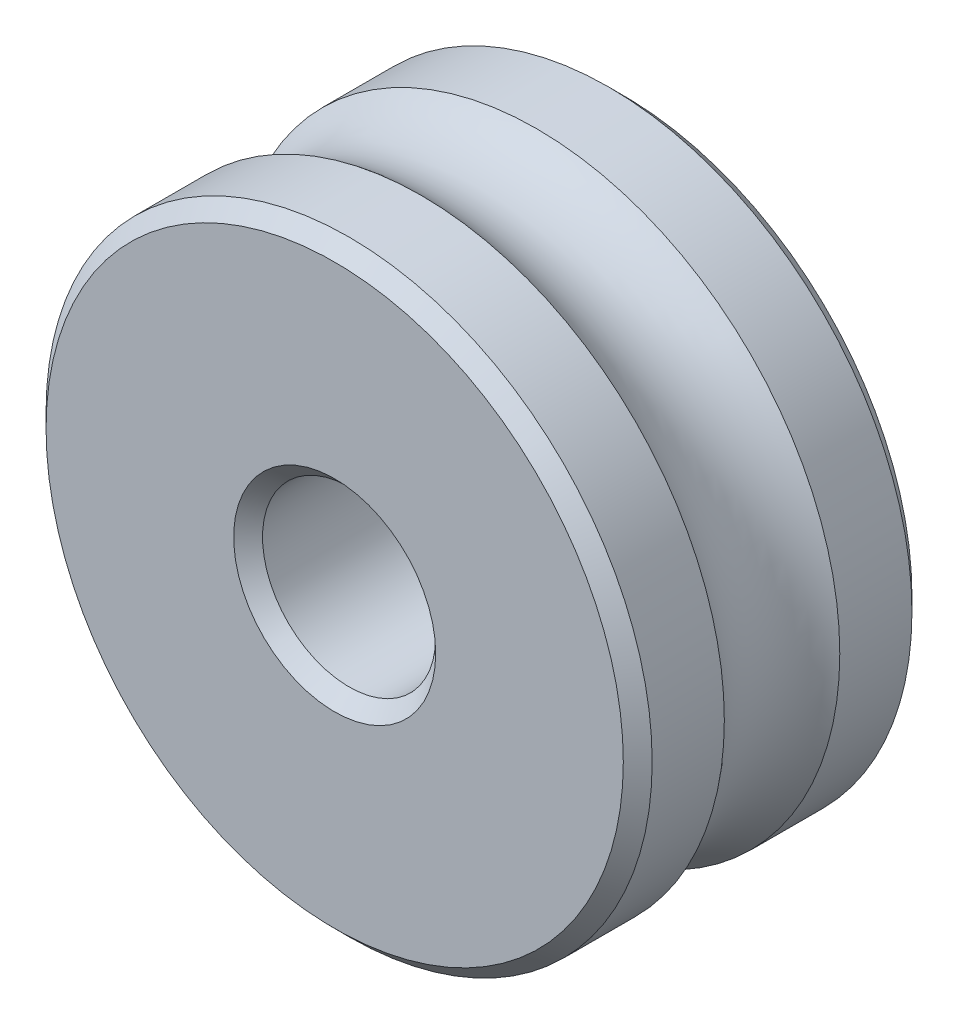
ISO-10303-21;
HEADER;
FILE_DESCRIPTION(('STEP AP214'),'2;1');
FILE_NAME('part.step','',(''),(''),'','','');
FILE_SCHEMA(('AUTOMOTIVE_DESIGN { 1 0 10303 214 1 1 1 1 }'));
ENDSEC;
DATA;
#1=APPLICATION_CONTEXT('core data for automotive mechanical design processes');
#2=APPLICATION_PROTOCOL_DEFINITION('international standard','automotive_design',2000,#1);
#3=PRODUCT_CONTEXT('',#1,'mechanical');
#4=PRODUCT('Part','Part','',(#3));
#5=PRODUCT_RELATED_PRODUCT_CATEGORY('part','',(#4));
#6=PRODUCT_DEFINITION_FORMATION('','',#4);
#7=PRODUCT_DEFINITION_CONTEXT('part definition',#1,'design');
#8=PRODUCT_DEFINITION('design','',#6,#7);
#9=PRODUCT_DEFINITION_SHAPE('','',#8);
#10=(LENGTH_UNIT() NAMED_UNIT(*) SI_UNIT(.MILLI.,.METRE.));
#11=(NAMED_UNIT(*) PLANE_ANGLE_UNIT() SI_UNIT($,.RADIAN.));
#12=(NAMED_UNIT(*) SI_UNIT($,.STERADIAN.) SOLID_ANGLE_UNIT());
#13=UNCERTAINTY_MEASURE_WITH_UNIT(LENGTH_MEASURE(1.E-05),#10,'distance_accuracy_value','');
#14=(GEOMETRIC_REPRESENTATION_CONTEXT(3) GLOBAL_UNCERTAINTY_ASSIGNED_CONTEXT((#13)) GLOBAL_UNIT_ASSIGNED_CONTEXT((#10,
#11,#12)) REPRESENTATION_CONTEXT('',''));
#15=CARTESIAN_POINT('',(0.,0.,0.));
#16=DIRECTION('',(0.,0.,1.));
#17=DIRECTION('',(1.,0.,0.));
#18=AXIS2_PLACEMENT_3D('',#15,#16,#17);
#19=CARTESIAN_POINT('',(0.,0.,10.));
#20=DIRECTION('',(0.,0.,-1.));
#21=DIRECTION('',(-1.,0.,0.));
#22=AXIS2_PLACEMENT_3D('',#19,#20,#21);
#23=CYLINDRICAL_SURFACE('',#22,21.);
#24=CARTESIAN_POINT('',(0.,0.,9.));
#25=DIRECTION('',(0.,0.,1.));
#26=DIRECTION('',(1.,0.,0.));
#27=AXIS2_PLACEMENT_3D('',#24,#25,#26);
#28=CIRCLE('',#27,21.);
#29=CARTESIAN_POINT('',(21.,0.,9.));
#30=VERTEX_POINT('',#29);
#31=EDGE_CURVE('E53',#30,#30,#28,.F.);
#32=ORIENTED_EDGE('',*,*,#31,.T.);
#33=EDGE_LOOP('',(#32));
#34=FACE_BOUND('',#33,.T.);
#35=CARTESIAN_POINT('',(0.,0.,4.00000000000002));
#36=DIRECTION('',(0.,0.,1.));
#37=DIRECTION('',(0.,-1.,0.));
#38=AXIS2_PLACEMENT_3D('',#35,#36,#37);
#39=CIRCLE('',#38,21.);
#40=CARTESIAN_POINT('',(0.,-21.,4.00000000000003));
#41=VERTEX_POINT('',#40);
#42=EDGE_CURVE('E73',#41,#41,#39,.T.);
#43=ORIENTED_EDGE('',*,*,#42,.T.);
#44=EDGE_LOOP('',(#43));
#45=FACE_BOUND('',#44,.T.);
#46=ADVANCED_FACE('F37',(#34,#45),#23,.T.);
#47=CARTESIAN_POINT('',(0.,0.,-9.));
#48=DIRECTION('',(0.,0.,1.));
#49=DIRECTION('',(1.,0.,0.));
#50=AXIS2_PLACEMENT_3D('',#47,#48,#49);
#51=CIRCLE('',#50,21.);
#52=CARTESIAN_POINT('',(21.,0.,-9.));
#53=VERTEX_POINT('',#52);
#54=EDGE_CURVE('E10',#53,#53,#51,.T.);
#55=ORIENTED_EDGE('',*,*,#54,.T.);
#56=EDGE_LOOP('',(#55));
#57=FACE_BOUND('',#56,.T.);
#58=CARTESIAN_POINT('',(0.,0.,-3.99999999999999));
#59=DIRECTION('',(0.,0.,1.));
#60=DIRECTION('',(0.,-1.,0.));
#61=AXIS2_PLACEMENT_3D('',#58,#59,#60);
#62=CIRCLE('',#61,21.);
#63=CARTESIAN_POINT('',(0.,-21.,-3.99999999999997));
#64=VERTEX_POINT('',#63);
#65=EDGE_CURVE('E70',#64,#64,#62,.T.);
#66=ORIENTED_EDGE('',*,*,#65,.F.);
#67=EDGE_LOOP('',(#66));
#68=FACE_BOUND('',#67,.T.);
#69=ADVANCED_FACE('F95',(#57,#68),#23,.T.);
#70=CARTESIAN_POINT('',(0.,0.,10.));
#71=DIRECTION('',(0.,0.,1.));
#72=DIRECTION('',(1.,0.,0.));
#73=AXIS2_PLACEMENT_3D('',#70,#71,#72);
#74=PLANE('',#73);
#75=CARTESIAN_POINT('',(0.,0.,10.));
#76=DIRECTION('',(0.,0.,1.));
#77=DIRECTION('',(1.,0.,0.));
#78=AXIS2_PLACEMENT_3D('',#75,#76,#77);
#79=CIRCLE('',#78,7.00000000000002);
#80=CARTESIAN_POINT('',(7.00000000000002,0.,10.));
#81=VERTEX_POINT('',#80);
#82=EDGE_CURVE('E58',#81,#81,#79,.F.);
#83=ORIENTED_EDGE('',*,*,#82,.T.);
#84=EDGE_LOOP('',(#83));
#85=FACE_BOUND('',#84,.T.);
#86=CARTESIAN_POINT('',(0.,0.,10.));
#87=DIRECTION('',(0.,0.,1.));
#88=DIRECTION('',(1.,0.,0.));
#89=AXIS2_PLACEMENT_3D('',#86,#87,#88);
#90=CIRCLE('',#89,20.);
#91=CARTESIAN_POINT('',(20.,0.,10.));
#92=VERTEX_POINT('',#91);
#93=EDGE_CURVE('E61',#92,#92,#90,.T.);
#94=ORIENTED_EDGE('',*,*,#93,.T.);
#95=EDGE_LOOP('',(#94));
#96=FACE_BOUND('',#95,.T.);
#97=ADVANCED_FACE('F101',(#85,#96),#74,.T.);
#98=CARTESIAN_POINT('',(0.,0.,-10.));
#99=DIRECTION('',(0.,0.,1.));
#100=DIRECTION('',(1.,0.,0.));
#101=AXIS2_PLACEMENT_3D('',#98,#99,#100);
#102=PLANE('',#101);
#103=CARTESIAN_POINT('',(0.,0.,-10.));
#104=DIRECTION('',(0.,0.,1.));
#105=DIRECTION('',(1.,0.,0.));
#106=AXIS2_PLACEMENT_3D('',#103,#104,#105);
#107=CIRCLE('',#106,7.);
#108=CARTESIAN_POINT('',(7.,0.,-10.));
#109=VERTEX_POINT('',#108);
#110=EDGE_CURVE('E45',#109,#109,#107,.T.);
#111=ORIENTED_EDGE('',*,*,#110,.T.);
#112=EDGE_LOOP('',(#111));
#113=FACE_BOUND('',#112,.T.);
#114=CARTESIAN_POINT('',(0.,0.,-10.));
#115=DIRECTION('',(0.,0.,1.));
#116=DIRECTION('',(1.,0.,0.));
#117=AXIS2_PLACEMENT_3D('',#114,#115,#116);
#118=CIRCLE('',#117,20.);
#119=CARTESIAN_POINT('',(20.,0.,-10.));
#120=VERTEX_POINT('',#119);
#121=EDGE_CURVE('E49',#120,#120,#118,.F.);
#122=ORIENTED_EDGE('',*,*,#121,.T.);
#123=EDGE_LOOP('',(#122));
#124=FACE_BOUND('',#123,.T.);
#125=ADVANCED_FACE('F91',(#113,#124),#102,.F.);
#126=CARTESIAN_POINT('',(0.,0.,10.));
#127=DIRECTION('',(0.,0.,-1.));
#128=DIRECTION('',(-1.,0.,0.));
#129=AXIS2_PLACEMENT_3D('',#126,#127,#128);
#130=CYLINDRICAL_SURFACE('',#129,6.);
#131=CARTESIAN_POINT('',(0.,0.,8.99999999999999));
#132=DIRECTION('',(0.,0.,1.));
#133=DIRECTION('',(1.,0.,0.));
#134=AXIS2_PLACEMENT_3D('',#131,#132,#133);
#135=CIRCLE('',#134,6.);
#136=CARTESIAN_POINT('',(6.,0.,8.99999999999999));
#137=VERTEX_POINT('',#136);
#138=EDGE_CURVE('E64',#137,#137,#135,.T.);
#139=ORIENTED_EDGE('',*,*,#138,.T.);
#140=EDGE_LOOP('',(#139));
#141=FACE_BOUND('',#140,.T.);
#142=CARTESIAN_POINT('',(0.,0.,-9.));
#143=DIRECTION('',(0.,0.,1.));
#144=DIRECTION('',(1.,0.,0.));
#145=AXIS2_PLACEMENT_3D('',#142,#143,#144);
#146=CIRCLE('',#145,6.);
#147=CARTESIAN_POINT('',(6.,0.,-9.));
#148=VERTEX_POINT('',#147);
#149=EDGE_CURVE('E67',#148,#148,#146,.F.);
#150=ORIENTED_EDGE('',*,*,#149,.T.);
#151=EDGE_LOOP('',(#150));
#152=FACE_BOUND('',#151,.T.);
#153=ADVANCED_FACE('F81',(#141,#152),#130,.F.);
#154=CARTESIAN_POINT('',(0.,0.,0.));
#155=DIRECTION('',(0.,0.,1.));
#156=DIRECTION('',(0.,-1.,0.));
#157=AXIS2_PLACEMENT_3D('',#154,#155,#156);
#158=TOROIDAL_SURFACE('',#157,25.4721359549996,6.);
#159=ORIENTED_EDGE('',*,*,#65,.T.);
#160=EDGE_LOOP('',(#159));
#161=FACE_BOUND('',#160,.T.);
#162=ORIENTED_EDGE('',*,*,#42,.F.);
#163=EDGE_LOOP('',(#162));
#164=FACE_BOUND('',#163,.T.);
#165=ADVANCED_FACE('F78',(#161,#164),#158,.F.);
#166=CARTESIAN_POINT('',(0.,0.,8.99999999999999));
#167=DIRECTION('',(0.,0.,1.));
#168=DIRECTION('',(1.,0.,0.));
#169=AXIS2_PLACEMENT_3D('',#166,#167,#168);
#170=CONICAL_SURFACE('',#169,6.,0.785398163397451);
#171=ORIENTED_EDGE('',*,*,#82,.F.);
#172=EDGE_LOOP('',(#171));
#173=FACE_BOUND('',#172,.T.);
#174=ORIENTED_EDGE('',*,*,#138,.F.);
#175=EDGE_LOOP('',(#174));
#176=FACE_BOUND('',#175,.T.);
#177=ADVANCED_FACE('F80',(#173,#176),#170,.F.);
#178=CARTESIAN_POINT('',(0.,0.,10.));
#179=DIRECTION('',(0.,0.,-1.));
#180=DIRECTION('',(-1.,0.,0.));
#181=AXIS2_PLACEMENT_3D('',#178,#179,#180);
#182=CONICAL_SURFACE('',#181,20.,0.785398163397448);
#183=ORIENTED_EDGE('',*,*,#31,.F.);
#184=EDGE_LOOP('',(#183));
#185=FACE_BOUND('',#184,.T.);
#186=ORIENTED_EDGE('',*,*,#93,.F.);
#187=EDGE_LOOP('',(#186));
#188=FACE_BOUND('',#187,.T.);
#189=ADVANCED_FACE('F88',(#185,#188),#182,.T.);
#190=CARTESIAN_POINT('',(0.,0.,-10.));
#191=DIRECTION('',(0.,0.,-1.));
#192=DIRECTION('',(-1.,0.,0.));
#193=AXIS2_PLACEMENT_3D('',#190,#191,#192);
#194=CONICAL_SURFACE('',#193,7.,0.785398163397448);
#195=ORIENTED_EDGE('',*,*,#149,.F.);
#196=EDGE_LOOP('',(#195));
#197=FACE_BOUND('',#196,.T.);
#198=ORIENTED_EDGE('',*,*,#110,.F.);
#199=EDGE_LOOP('',(#198));
#200=FACE_BOUND('',#199,.T.);
#201=ADVANCED_FACE('F113',(#197,#200),#194,.F.);
#202=CARTESIAN_POINT('',(0.,0.,-9.));
#203=DIRECTION('',(0.,0.,1.));
#204=DIRECTION('',(1.,0.,0.));
#205=AXIS2_PLACEMENT_3D('',#202,#203,#204);
#206=CONICAL_SURFACE('',#205,21.,0.78539816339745);
#207=ORIENTED_EDGE('',*,*,#121,.F.);
#208=EDGE_LOOP('',(#207));
#209=FACE_BOUND('',#208,.T.);
#210=ORIENTED_EDGE('',*,*,#54,.F.);
#211=EDGE_LOOP('',(#210));
#212=FACE_BOUND('',#211,.T.);
#213=ADVANCED_FACE('F40',(#209,#212),#206,.T.);
#214=CLOSED_SHELL('',(#46,#69,#97,#125,#153,#165,#177,#189,#201,#213));
#215=MANIFOLD_SOLID_BREP('B2',#214);
#216=ADVANCED_BREP_SHAPE_REPRESENTATION('',(#18,#215),#14);
#217=SHAPE_DEFINITION_REPRESENTATION(#9,#216);
ENDSEC;
END-ISO-10303-21;
